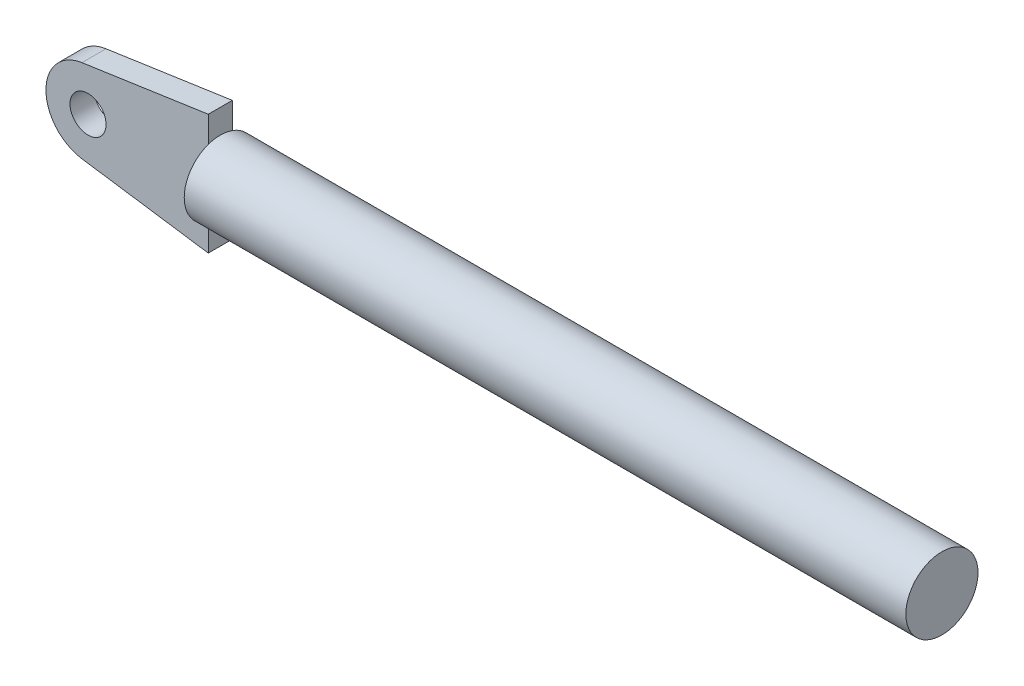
from build123d import *

# Parameters (mm, degrees)
SKETCH1_R           = 30
BOSS_EXTRUDE1_DEPTH = 600
SKETCH3_R           = 15
BOSS_EXTRUDE2_DEPTH = 10


with BuildPart() as part:
    # Sketch1 → Boss-Extrude1 (new body)
    with BuildSketch(Plane(origin=(0, 0, 0), x_dir=(0, 0, -1), z_dir=(1, 0, 0))):
        Circle(SKETCH1_R)
    extrude(amount=BOSS_EXTRUDE1_DEPTH)

    # Sketch3 → Boss-Extrude2 (add, symmetric)
    with BuildSketch(Plane.XY):
        with BuildLine():
            Line((0, -50), (0, 50))
            Line((0, 50), (-105.065732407, 34.631464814))
            ThreePointArc((-105.065732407, 34.631464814), (-135, 0), (-105.065732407, -34.631464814))
            Line((-105.065732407, -34.631464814), (0, -50))
        make_face()
        with Locations((-100, 0)):
            Circle(SKETCH3_R, mode=Mode.SUBTRACT)
    extrude(amount=BOSS_EXTRUDE2_DEPTH, both=True)


solid = part.part
